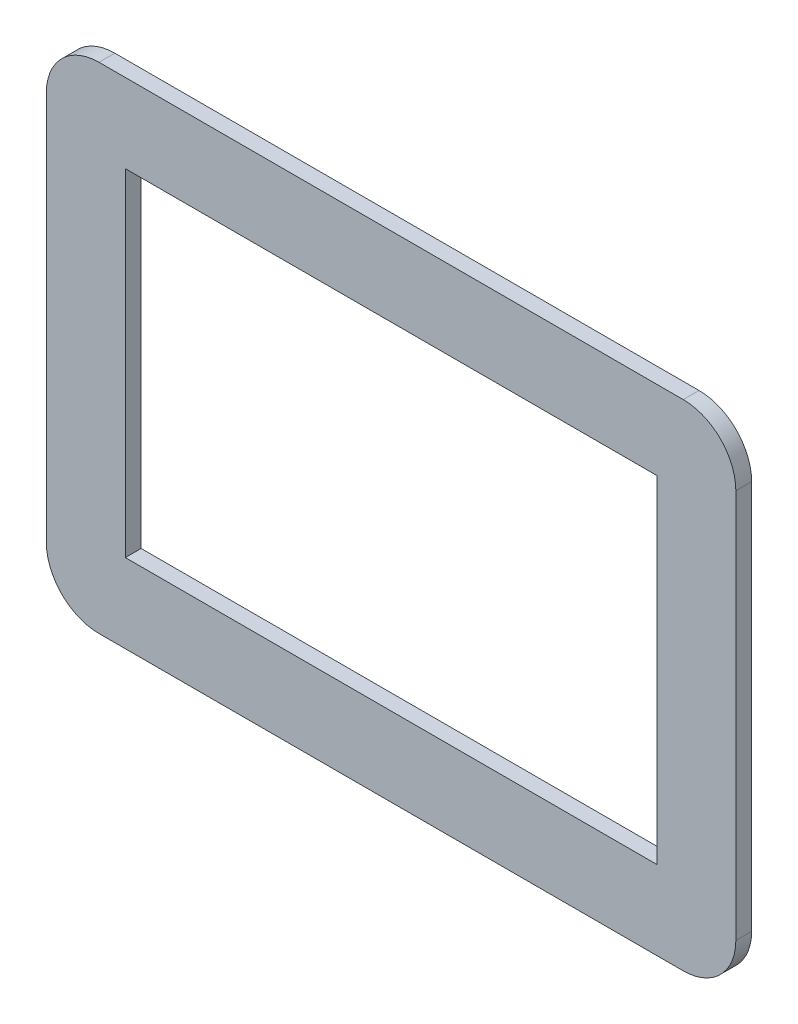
from build123d import *

# Parameters (mm, degrees)
ESQUISSE1_W        = 202
ESQUISSE1_H        = 128
EXTRU_MINCE1_DEPTH = 6


with BuildPart() as part:
    # Esquisse1 → Extru.-Mince1 (new body)
    with BuildSketch(Plane.XY):
        with BuildLine():
            Line((-131, -74), (-131, 74))
            ThreePointArc((-131, 74), (-125.142135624, 88.142135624), (-111, 94))
            Line((-111, 94), (111, 94))
            ThreePointArc((111, 94), (125.142135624, 88.142135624), (131, 74))
            Line((131, 74), (131, -74))
            ThreePointArc((131, -74), (125.142135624, -88.142135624), (111, -94))
            Line((111, -94), (-111, -94))
            ThreePointArc((-111, -94), (-125.142135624, -88.142135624), (-131, -74))
        make_face()
        Rectangle(ESQUISSE1_W, ESQUISSE1_H, mode=Mode.SUBTRACT)
    extrude(amount=EXTRU_MINCE1_DEPTH)


solid = part.part
